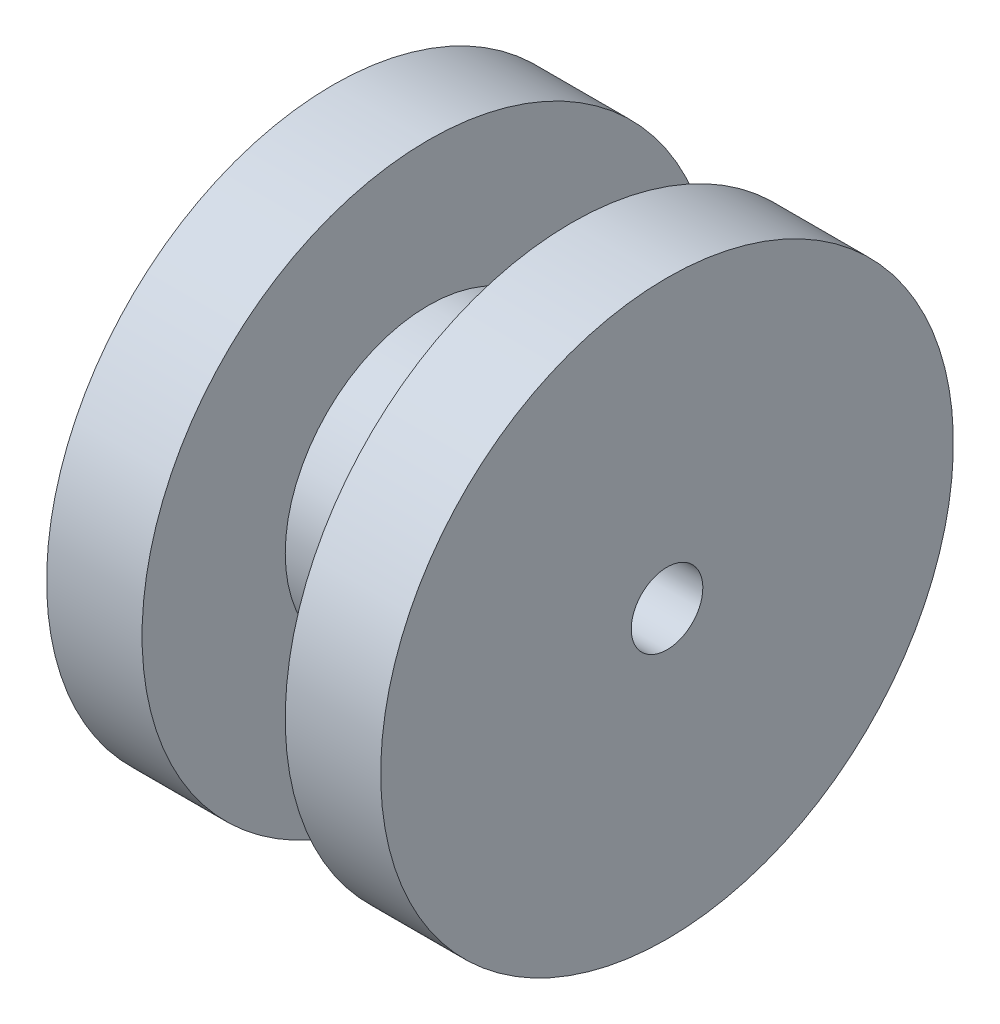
ISO-10303-21;
HEADER;
FILE_DESCRIPTION(('STEP AP214'),'2;1');
FILE_NAME('part.step','',(''),(''),'','','');
FILE_SCHEMA(('AUTOMOTIVE_DESIGN { 1 0 10303 214 1 1 1 1 }'));
ENDSEC;
DATA;
#1=APPLICATION_CONTEXT('core data for automotive mechanical design processes');
#2=APPLICATION_PROTOCOL_DEFINITION('international standard','automotive_design',2000,#1);
#3=PRODUCT_CONTEXT('',#1,'mechanical');
#4=PRODUCT('Part','Part','',(#3));
#5=PRODUCT_RELATED_PRODUCT_CATEGORY('part','',(#4));
#6=PRODUCT_DEFINITION_FORMATION('','',#4);
#7=PRODUCT_DEFINITION_CONTEXT('part definition',#1,'design');
#8=PRODUCT_DEFINITION('design','',#6,#7);
#9=PRODUCT_DEFINITION_SHAPE('','',#8);
#10=(LENGTH_UNIT() NAMED_UNIT(*) SI_UNIT(.MILLI.,.METRE.));
#11=(NAMED_UNIT(*) PLANE_ANGLE_UNIT() SI_UNIT($,.RADIAN.));
#12=(NAMED_UNIT(*) SI_UNIT($,.STERADIAN.) SOLID_ANGLE_UNIT());
#13=UNCERTAINTY_MEASURE_WITH_UNIT(LENGTH_MEASURE(1.E-05),#10,'distance_accuracy_value','');
#14=(GEOMETRIC_REPRESENTATION_CONTEXT(3) GLOBAL_UNCERTAINTY_ASSIGNED_CONTEXT((#13)) GLOBAL_UNIT_ASSIGNED_CONTEXT((#10,
#11,#12)) REPRESENTATION_CONTEXT('',''));
#15=CARTESIAN_POINT('',(0.,0.,0.));
#16=DIRECTION('',(0.,0.,1.));
#17=DIRECTION('',(1.,0.,0.));
#18=AXIS2_PLACEMENT_3D('',#15,#16,#17);
#19=CARTESIAN_POINT('',(-7.,0.,0.));
#20=DIRECTION('',(1.,0.,0.));
#21=DIRECTION('',(0.,1.,0.));
#22=AXIS2_PLACEMENT_3D('',#19,#20,#21);
#23=PLANE('',#22);
#24=CARTESIAN_POINT('',(-7.,0.,0.));
#25=DIRECTION('',(-1.,0.,0.));
#26=DIRECTION('',(0.,-1.,0.));
#27=AXIS2_PLACEMENT_3D('',#24,#25,#26);
#28=CIRCLE('',#27,1.5);
#29=CARTESIAN_POINT('',(-7.,-1.5,0.));
#30=VERTEX_POINT('',#29);
#31=EDGE_CURVE('E52',#30,#30,#28,.T.);
#32=ORIENTED_EDGE('',*,*,#31,.F.);
#33=EDGE_LOOP('',(#32));
#34=FACE_BOUND('',#33,.T.);
#35=CARTESIAN_POINT('',(-7.,0.,0.));
#36=DIRECTION('',(-1.,0.,0.));
#37=DIRECTION('',(0.,-1.,0.));
#38=AXIS2_PLACEMENT_3D('',#35,#36,#37);
#39=CIRCLE('',#38,12.);
#40=CARTESIAN_POINT('',(-7.,-12.,0.));
#41=VERTEX_POINT('',#40);
#42=EDGE_CURVE('E10',#41,#41,#39,.T.);
#43=ORIENTED_EDGE('',*,*,#42,.T.);
#44=EDGE_LOOP('',(#43));
#45=FACE_BOUND('',#44,.T.);
#46=ADVANCED_FACE('F24',(#34,#45),#23,.F.);
#47=CARTESIAN_POINT('',(-17.3245872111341,0.,0.));
#48=DIRECTION('',(-1.,0.,0.));
#49=DIRECTION('',(0.,-1.,0.));
#50=AXIS2_PLACEMENT_3D('',#47,#48,#49);
#51=CYLINDRICAL_SURFACE('',#50,12.);
#52=ORIENTED_EDGE('',*,*,#42,.F.);
#53=EDGE_LOOP('',(#52));
#54=FACE_BOUND('',#53,.T.);
#55=CARTESIAN_POINT('',(-3.,0.,0.));
#56=DIRECTION('',(-1.,0.,0.));
#57=DIRECTION('',(0.,-1.,0.));
#58=AXIS2_PLACEMENT_3D('',#55,#56,#57);
#59=CIRCLE('',#58,12.);
#60=CARTESIAN_POINT('',(-3.,-12.,0.));
#61=VERTEX_POINT('',#60);
#62=EDGE_CURVE('E30',#61,#61,#59,.T.);
#63=ORIENTED_EDGE('',*,*,#62,.T.);
#64=EDGE_LOOP('',(#63));
#65=FACE_BOUND('',#64,.T.);
#66=ADVANCED_FACE('F59',(#54,#65),#51,.T.);
#67=CARTESIAN_POINT('',(-3.,12.,0.));
#68=DIRECTION('',(-1.,0.,0.));
#69=DIRECTION('',(0.,-1.,0.));
#70=AXIS2_PLACEMENT_3D('',#67,#68,#69);
#71=PLANE('',#70);
#72=ORIENTED_EDGE('',*,*,#62,.F.);
#73=EDGE_LOOP('',(#72));
#74=FACE_BOUND('',#73,.T.);
#75=CARTESIAN_POINT('',(-3.,0.,0.));
#76=DIRECTION('',(-1.,0.,0.));
#77=DIRECTION('',(0.,-1.,0.));
#78=AXIS2_PLACEMENT_3D('',#75,#76,#77);
#79=CIRCLE('',#78,6.);
#80=CARTESIAN_POINT('',(-3.,-6.,0.));
#81=VERTEX_POINT('',#80);
#82=EDGE_CURVE('E34',#81,#81,#79,.T.);
#83=ORIENTED_EDGE('',*,*,#82,.T.);
#84=EDGE_LOOP('',(#83));
#85=FACE_BOUND('',#84,.T.);
#86=ADVANCED_FACE('F65',(#74,#85),#71,.F.);
#87=CARTESIAN_POINT('',(-17.3245872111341,0.,0.));
#88=DIRECTION('',(-1.,0.,0.));
#89=DIRECTION('',(0.,-1.,0.));
#90=AXIS2_PLACEMENT_3D('',#87,#88,#89);
#91=CYLINDRICAL_SURFACE('',#90,6.);
#92=ORIENTED_EDGE('',*,*,#82,.F.);
#93=EDGE_LOOP('',(#92));
#94=FACE_BOUND('',#93,.T.);
#95=CARTESIAN_POINT('',(3.,0.,0.));
#96=DIRECTION('',(-1.,0.,0.));
#97=DIRECTION('',(0.,-1.,0.));
#98=AXIS2_PLACEMENT_3D('',#95,#96,#97);
#99=CIRCLE('',#98,6.);
#100=CARTESIAN_POINT('',(3.,-6.,0.));
#101=VERTEX_POINT('',#100);
#102=EDGE_CURVE('E38',#101,#101,#99,.T.);
#103=ORIENTED_EDGE('',*,*,#102,.T.);
#104=EDGE_LOOP('',(#103));
#105=FACE_BOUND('',#104,.T.);
#106=ADVANCED_FACE('F70',(#94,#105),#91,.T.);
#107=CARTESIAN_POINT('',(3.,12.,0.));
#108=DIRECTION('',(1.,0.,0.));
#109=DIRECTION('',(0.,1.,0.));
#110=AXIS2_PLACEMENT_3D('',#107,#108,#109);
#111=PLANE('',#110);
#112=ORIENTED_EDGE('',*,*,#102,.F.);
#113=EDGE_LOOP('',(#112));
#114=FACE_BOUND('',#113,.T.);
#115=CARTESIAN_POINT('',(3.,0.,0.));
#116=DIRECTION('',(-1.,0.,0.));
#117=DIRECTION('',(0.,-1.,0.));
#118=AXIS2_PLACEMENT_3D('',#115,#116,#117);
#119=CIRCLE('',#118,12.);
#120=CARTESIAN_POINT('',(3.,-12.,0.));
#121=VERTEX_POINT('',#120);
#122=EDGE_CURVE('E43',#121,#121,#119,.T.);
#123=ORIENTED_EDGE('',*,*,#122,.T.);
#124=EDGE_LOOP('',(#123));
#125=FACE_BOUND('',#124,.T.);
#126=ADVANCED_FACE('F76',(#114,#125),#111,.F.);
#127=CARTESIAN_POINT('',(-17.3245872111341,0.,0.));
#128=DIRECTION('',(-1.,0.,0.));
#129=DIRECTION('',(0.,-1.,0.));
#130=AXIS2_PLACEMENT_3D('',#127,#128,#129);
#131=CYLINDRICAL_SURFACE('',#130,12.);
#132=ORIENTED_EDGE('',*,*,#122,.F.);
#133=EDGE_LOOP('',(#132));
#134=FACE_BOUND('',#133,.T.);
#135=CARTESIAN_POINT('',(7.,0.,0.));
#136=DIRECTION('',(-1.,0.,0.));
#137=DIRECTION('',(0.,-1.,0.));
#138=AXIS2_PLACEMENT_3D('',#135,#136,#137);
#139=CIRCLE('',#138,12.);
#140=CARTESIAN_POINT('',(7.,-12.,0.));
#141=VERTEX_POINT('',#140);
#142=EDGE_CURVE('E46',#141,#141,#139,.T.);
#143=ORIENTED_EDGE('',*,*,#142,.T.);
#144=EDGE_LOOP('',(#143));
#145=FACE_BOUND('',#144,.T.);
#146=ADVANCED_FACE('F80',(#134,#145),#131,.T.);
#147=CARTESIAN_POINT('',(7.,0.,0.));
#148=DIRECTION('',(-1.,0.,0.));
#149=DIRECTION('',(0.,-1.,0.));
#150=AXIS2_PLACEMENT_3D('',#147,#148,#149);
#151=PLANE('',#150);
#152=CARTESIAN_POINT('',(7.,0.,0.));
#153=DIRECTION('',(-1.,0.,0.));
#154=DIRECTION('',(0.,-1.,0.));
#155=AXIS2_PLACEMENT_3D('',#152,#153,#154);
#156=CIRCLE('',#155,1.5);
#157=CARTESIAN_POINT('',(7.,-1.5,0.));
#158=VERTEX_POINT('',#157);
#159=EDGE_CURVE('E49',#158,#158,#156,.T.);
#160=ORIENTED_EDGE('',*,*,#159,.T.);
#161=EDGE_LOOP('',(#160));
#162=FACE_BOUND('',#161,.T.);
#163=ORIENTED_EDGE('',*,*,#142,.F.);
#164=EDGE_LOOP('',(#163));
#165=FACE_BOUND('',#164,.T.);
#166=ADVANCED_FACE('F83',(#162,#165),#151,.F.);
#167=CARTESIAN_POINT('',(7.,0.,0.));
#168=DIRECTION('',(-1.,0.,0.));
#169=DIRECTION('',(0.,-1.,0.));
#170=AXIS2_PLACEMENT_3D('',#167,#168,#169);
#171=CYLINDRICAL_SURFACE('',#170,1.5);
#172=CARTESIAN_POINT('',(7.,-1.5,0.));
#173=CARTESIAN_POINT('',(6.85416666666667,-1.5,0.));
#174=CARTESIAN_POINT('',(6.70833333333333,-1.5,0.));
#175=CARTESIAN_POINT('',(6.41666666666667,-1.5,0.));
#176=CARTESIAN_POINT('',(6.27083333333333,-1.5,0.));
#177=CARTESIAN_POINT('',(5.97916666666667,-1.5,0.));
#178=CARTESIAN_POINT('',(5.83333333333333,-1.5,0.));
#179=CARTESIAN_POINT('',(5.54166666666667,-1.5,0.));
#180=CARTESIAN_POINT('',(5.39583333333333,-1.5,0.));
#181=CARTESIAN_POINT('',(5.10416666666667,-1.5,0.));
#182=CARTESIAN_POINT('',(4.95833333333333,-1.5,0.));
#183=CARTESIAN_POINT('',(4.66666666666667,-1.5,0.));
#184=CARTESIAN_POINT('',(4.52083333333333,-1.5,0.));
#185=CARTESIAN_POINT('',(4.22916666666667,-1.5,0.));
#186=CARTESIAN_POINT('',(4.08333333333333,-1.5,0.));
#187=CARTESIAN_POINT('',(3.79166666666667,-1.5,0.));
#188=CARTESIAN_POINT('',(3.64583333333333,-1.5,0.));
#189=CARTESIAN_POINT('',(3.35416666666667,-1.5,0.));
#190=CARTESIAN_POINT('',(3.20833333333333,-1.5,0.));
#191=CARTESIAN_POINT('',(2.91666666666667,-1.5,0.));
#192=CARTESIAN_POINT('',(2.77083333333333,-1.5,0.));
#193=CARTESIAN_POINT('',(2.47916666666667,-1.5,0.));
#194=CARTESIAN_POINT('',(2.33333333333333,-1.5,0.));
#195=CARTESIAN_POINT('',(2.04166666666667,-1.5,0.));
#196=CARTESIAN_POINT('',(1.89583333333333,-1.5,0.));
#197=CARTESIAN_POINT('',(1.60416666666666,-1.5,0.));
#198=CARTESIAN_POINT('',(1.45833333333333,-1.5,0.));
#199=CARTESIAN_POINT('',(1.16666666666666,-1.5,0.));
#200=CARTESIAN_POINT('',(1.02083333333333,-1.5,0.));
#201=CARTESIAN_POINT('',(0.729166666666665,-1.5,0.));
#202=CARTESIAN_POINT('',(0.583333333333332,-1.5,0.));
#203=CARTESIAN_POINT('',(0.291666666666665,-1.5,0.));
#204=CARTESIAN_POINT('',(0.145833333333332,-1.5,0.));
#205=CARTESIAN_POINT('',(-0.145833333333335,-1.5,0.));
#206=CARTESIAN_POINT('',(-0.291666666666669,-1.5,0.));
#207=CARTESIAN_POINT('',(-0.583333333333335,-1.5,0.));
#208=CARTESIAN_POINT('',(-0.729166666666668,-1.5,0.));
#209=CARTESIAN_POINT('',(-1.02083333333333,-1.5,0.));
#210=CARTESIAN_POINT('',(-1.16666666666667,-1.5,0.));
#211=CARTESIAN_POINT('',(-1.45833333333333,-1.5,0.));
#212=CARTESIAN_POINT('',(-1.60416666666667,-1.5,0.));
#213=CARTESIAN_POINT('',(-1.89583333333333,-1.5,0.));
#214=CARTESIAN_POINT('',(-2.04166666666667,-1.5,0.));
#215=CARTESIAN_POINT('',(-2.33333333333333,-1.5,0.));
#216=CARTESIAN_POINT('',(-2.47916666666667,-1.5,0.));
#217=CARTESIAN_POINT('',(-2.77083333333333,-1.5,0.));
#218=CARTESIAN_POINT('',(-2.91666666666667,-1.5,0.));
#219=CARTESIAN_POINT('',(-3.20833333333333,-1.5,0.));
#220=CARTESIAN_POINT('',(-3.35416666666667,-1.5,0.));
#221=CARTESIAN_POINT('',(-3.64583333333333,-1.5,0.));
#222=CARTESIAN_POINT('',(-3.79166666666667,-1.5,0.));
#223=CARTESIAN_POINT('',(-4.08333333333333,-1.5,0.));
#224=CARTESIAN_POINT('',(-4.22916666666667,-1.5,0.));
#225=CARTESIAN_POINT('',(-4.52083333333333,-1.5,0.));
#226=CARTESIAN_POINT('',(-4.66666666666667,-1.5,0.));
#227=CARTESIAN_POINT('',(-4.95833333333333,-1.5,0.));
#228=CARTESIAN_POINT('',(-5.10416666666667,-1.5,0.));
#229=CARTESIAN_POINT('',(-5.39583333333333,-1.5,0.));
#230=CARTESIAN_POINT('',(-5.54166666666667,-1.5,0.));
#231=CARTESIAN_POINT('',(-5.83333333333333,-1.5,0.));
#232=CARTESIAN_POINT('',(-5.97916666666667,-1.5,0.));
#233=CARTESIAN_POINT('',(-6.27083333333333,-1.5,0.));
#234=CARTESIAN_POINT('',(-6.41666666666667,-1.5,0.));
#235=CARTESIAN_POINT('',(-6.70833333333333,-1.5,0.));
#236=CARTESIAN_POINT('',(-6.85416666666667,-1.5,0.));
#237=CARTESIAN_POINT('',(-7.,-1.5,0.));
#238=B_SPLINE_CURVE_WITH_KNOTS('',3,(#172,#173,#174,#175,#176,#177,#178,#179,#180,#181,#182,
#183,#184,#185,#186,#187,#188,#189,#190,#191,#192,#193,#194,#195,#196,#197,#198,#199,#200,#201,
#202,#203,#204,#205,#206,#207,#208,#209,#210,#211,#212,#213,#214,#215,#216,#217,#218,#219,#220,
#221,#222,#223,#224,#225,#226,#227,#228,#229,#230,#231,#232,#233,#234,#235,#236,#237),
.UNSPECIFIED.,.F.,.F.,(4,2,2,2,2,2,2,2,2,2,2,2,2,2,2,2,2,2,2,2,2,2,2,2,2,2,2,2,2,2,2,2,4),(0.,
0.4375,0.875,1.3125,1.75,2.1875,2.625,3.0625,3.5,3.9375,4.375,4.8125,5.25,5.6875,6.125,6.5625,
7.,7.4375,7.875,8.3125,8.75,9.1875,9.625,10.0625,10.5,10.9375,11.375,11.8125,12.25,12.6875,
13.125,13.5625,14.),.UNSPECIFIED.);
#239=EDGE_CURVE('BSEAM56',#158,#30,#238,.T.);
#240=ORIENTED_EDGE('',*,*,#159,.F.);
#241=ORIENTED_EDGE('',*,*,#31,.T.);
#242=ORIENTED_EDGE('',*,*,#239,.T.);
#243=ORIENTED_EDGE('',*,*,#239,.F.);
#244=EDGE_LOOP('',(#240,#242,#241,#243));
#245=FACE_BOUND('',#244,.T.);
#246=ADVANCED_FACE('F56',(#245),#171,.F.);
#247=CLOSED_SHELL('',(#46,#66,#86,#106,#126,#146,#166,#246));
#248=MANIFOLD_SOLID_BREP('B2',#247);
#249=ADVANCED_BREP_SHAPE_REPRESENTATION('',(#18,#248),#14);
#250=SHAPE_DEFINITION_REPRESENTATION(#9,#249);
ENDSEC;
END-ISO-10303-21;
